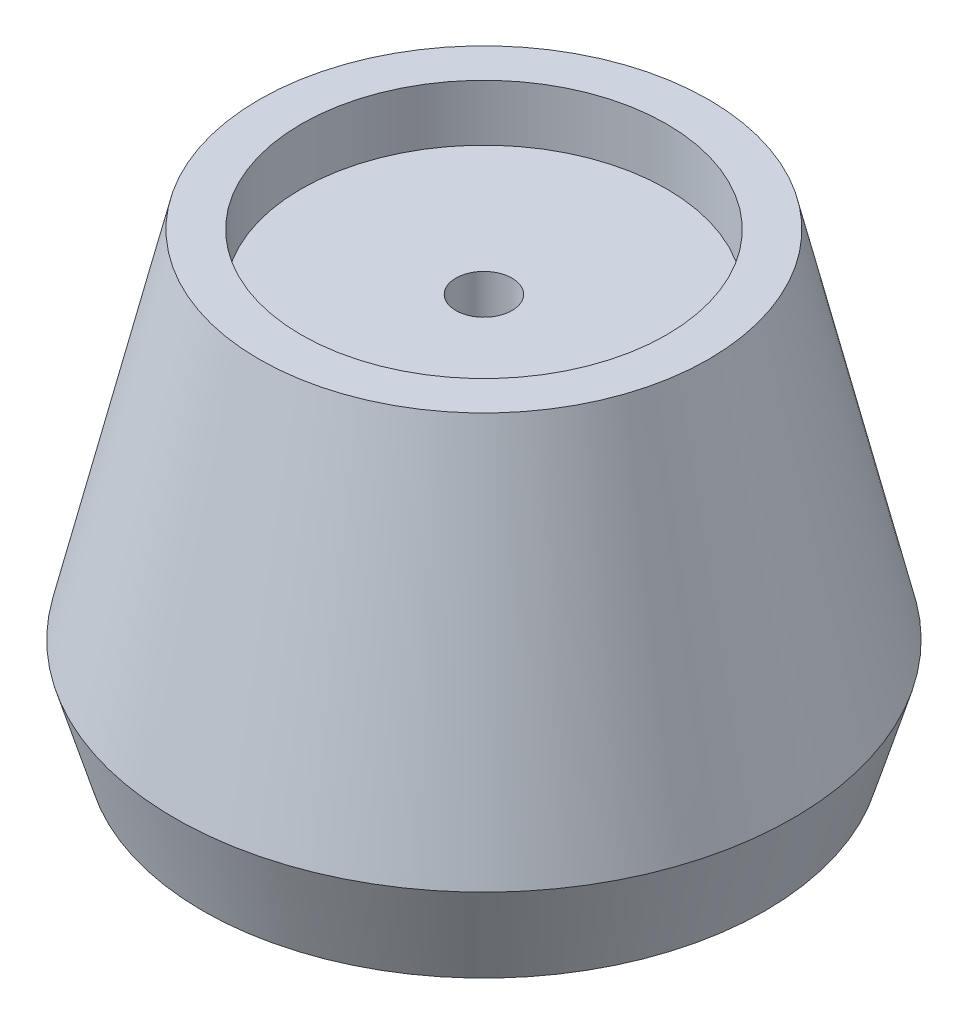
from build123d import *

# Parameters (mm, degrees)
SKETCH23_R         = 41.275
CUT_EXTRUDE3_DEPTH = 12.7
SKETCH24_R         = 6.35
CUT_EXTRUDE4_DEPTH = 152.4
SKETCH25_R         = 57.15
CUT_EXTRUDE5_DEPTH = 6.35


with BuildPart() as part:
    # Sketch22 → Revolve2 (revolve)
    with BuildSketch(Plane.XY, mode=Mode.PRIVATE) as revolve2_sk:
        Polygon((0, 0), (0, 101.6), (50.8, 101.6), (69.85, 21.302182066), (63.5, 0), align=None)
    revolve(revolve2_sk.sketch.rotate(Axis((0, 0, 0), (0, 1, 0)), 90), axis=Axis((0, 0, 0), (0, 1, 0)))

    # Sketch23 → Cut-Extrude3 (cut)
    with BuildSketch(Plane(origin=(0, 101.6, 0), x_dir=(1, 0, 0), z_dir=(0, 1, 0))):
        with Locations(Location((0, 0, 0), (0, 0, 270))):
            Circle(SKETCH23_R)
    extrude(amount=-CUT_EXTRUDE3_DEPTH, mode=Mode.SUBTRACT)

    # Sketch24 → Cut-Extrude4 (cut)
    with BuildSketch(Plane(origin=(0, 101.6, 0), x_dir=(1, 0, 0), z_dir=(0, 1, 0))):
        with Locations(Location((0, 0, 0), (0, 0, 270))):
            Circle(SKETCH24_R)
    extrude(amount=-CUT_EXTRUDE4_DEPTH, mode=Mode.SUBTRACT)

    # Sketch25 → Cut-Extrude5 (cut)
    with BuildSketch(Plane.XZ):
        with Locations(Location((0, 0, 0), (0, 0, 270))):
            Circle(SKETCH25_R)
    extrude(amount=-CUT_EXTRUDE5_DEPTH, mode=Mode.SUBTRACT)


solid = part.part
